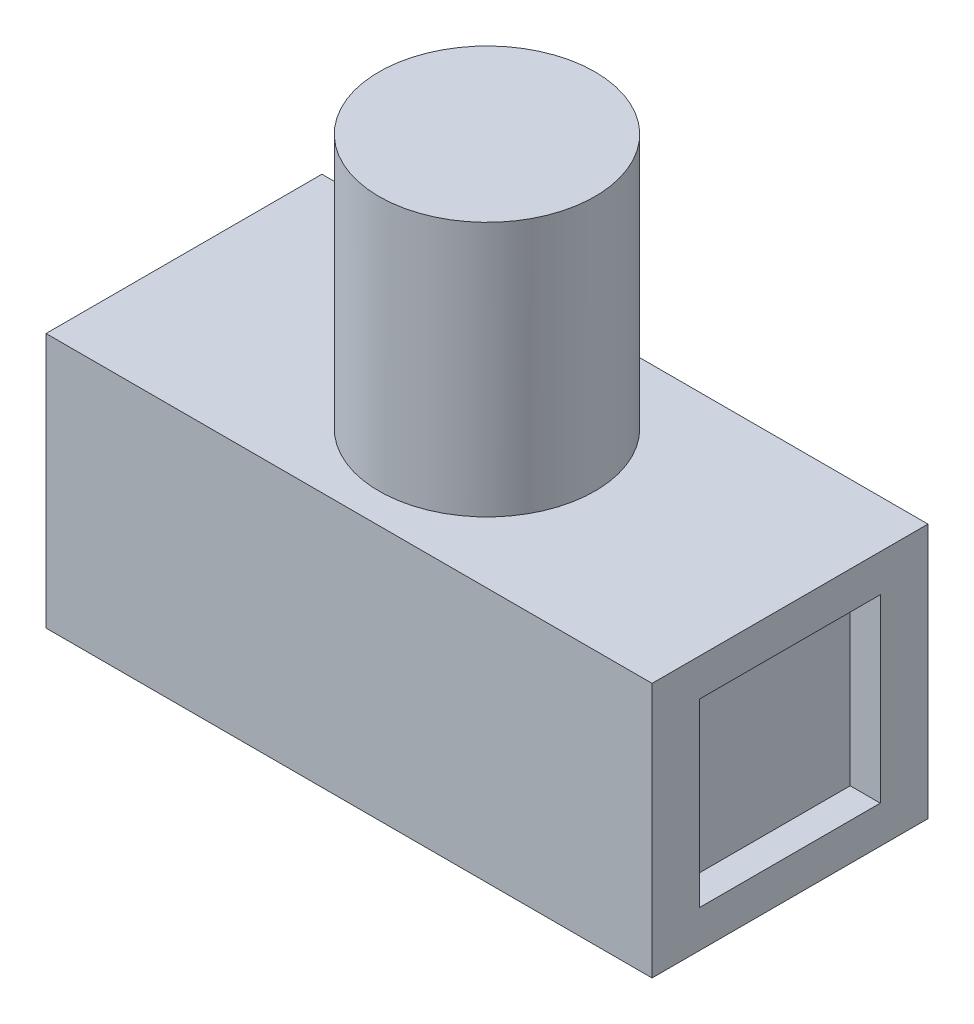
from build123d import *

# Parameters (mm, degrees)
SKETCH1_W           = 127.89654346
SKETCH1_H           = 58.225274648
BOSS_EXTRUDE1_DEPTH = 53.848
SKETCH2_R           = 22.794478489
BOSS_EXTRUDE2_DEPTH = 53.848
SKETCH3_W           = 38.1
SKETCH3_H           = 38.1
CUT_EXTRUDE1_DEPTH  = 6.35


with BuildPart() as part:
    # Sketch1 → Boss-Extrude1 (new body)
    with BuildSketch(Plane(origin=(0, 0, 0), x_dir=(1, 0, 0), z_dir=(0, 1, 0))):
        Rectangle(SKETCH1_W, SKETCH1_H)
    extrude(amount=BOSS_EXTRUDE1_DEPTH)

    # Sketch2 → Boss-Extrude2 (add)
    with BuildSketch(Plane(origin=(0, 53.848, 0), x_dir=(1, 0, 0), z_dir=(0, 1, 0))):
        with Locations(Location((0, 0, 0), (0, 0, 90))):
            Circle(SKETCH2_R)
    extrude(amount=BOSS_EXTRUDE2_DEPTH)

    # Sketch3 → Cut-Extrude1 (cut)
    with BuildSketch(Plane(origin=(63.94827173, 0, 0), x_dir=(0, 0, -1), z_dir=(1, 0, 0))):
        with Locations((0, 26.924)):
            Rectangle(SKETCH3_W, SKETCH3_H)
    extrude(amount=-CUT_EXTRUDE1_DEPTH, mode=Mode.SUBTRACT)


solid = part.part
